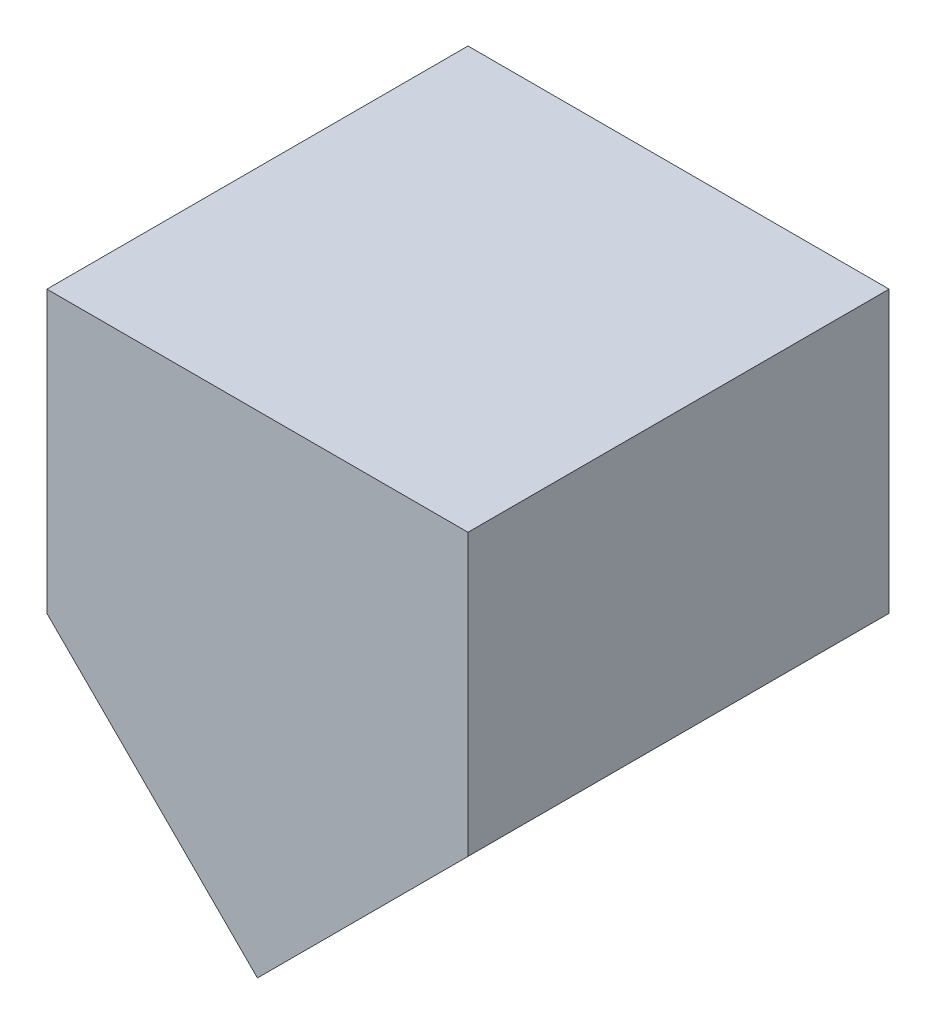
from build123d import *

# Parameters (mm, degrees)
EXTRUDE1_DEPTH = 15


with BuildPart() as part:
    # Sketch1 → Extrude1 (new, symmetric)
    with BuildSketch(Plane.XY):
        Polygon((0, 0), (-15, 15), (-15, 35), (15, 35), (15, 15), align=None)
    extrude(amount=EXTRUDE1_DEPTH, both=True)


solid = part.part
